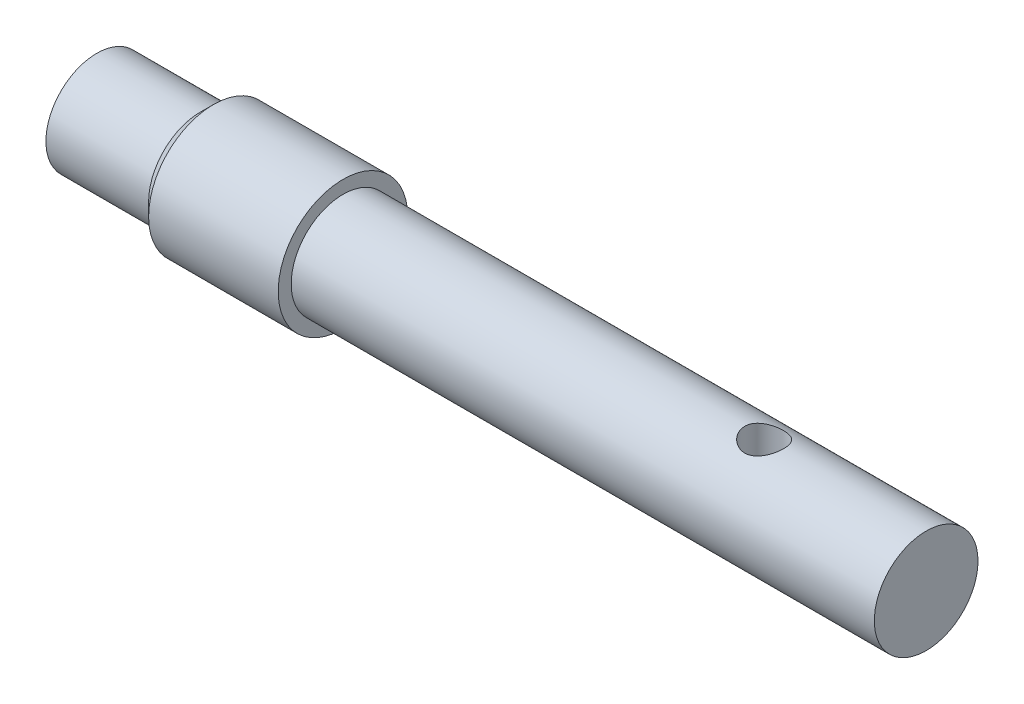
ISO-10303-21;
HEADER;
FILE_DESCRIPTION(('STEP AP214'),'2;1');
FILE_NAME('part.step','',(''),(''),'','','');
FILE_SCHEMA(('AUTOMOTIVE_DESIGN { 1 0 10303 214 1 1 1 1 }'));
ENDSEC;
DATA;
#1=APPLICATION_CONTEXT('core data for automotive mechanical design processes');
#2=APPLICATION_PROTOCOL_DEFINITION('international standard','automotive_design',2000,#1);
#3=PRODUCT_CONTEXT('',#1,'mechanical');
#4=PRODUCT('Part','Part','',(#3));
#5=PRODUCT_RELATED_PRODUCT_CATEGORY('part','',(#4));
#6=PRODUCT_DEFINITION_FORMATION('','',#4);
#7=PRODUCT_DEFINITION_CONTEXT('part definition',#1,'design');
#8=PRODUCT_DEFINITION('design','',#6,#7);
#9=PRODUCT_DEFINITION_SHAPE('','',#8);
#10=(LENGTH_UNIT() NAMED_UNIT(*) SI_UNIT(.MILLI.,.METRE.));
#11=(NAMED_UNIT(*) PLANE_ANGLE_UNIT() SI_UNIT($,.RADIAN.));
#12=(NAMED_UNIT(*) SI_UNIT($,.STERADIAN.) SOLID_ANGLE_UNIT());
#13=UNCERTAINTY_MEASURE_WITH_UNIT(LENGTH_MEASURE(1.E-05),#10,'distance_accuracy_value','');
#14=(GEOMETRIC_REPRESENTATION_CONTEXT(3) GLOBAL_UNCERTAINTY_ASSIGNED_CONTEXT((#13)) GLOBAL_UNIT_ASSIGNED_CONTEXT((#10,
#11,#12)) REPRESENTATION_CONTEXT('',''));
#15=CARTESIAN_POINT('',(0.,0.,0.));
#16=DIRECTION('',(0.,0.,1.));
#17=DIRECTION('',(1.,0.,0.));
#18=AXIS2_PLACEMENT_3D('',#15,#16,#17);
#19=CARTESIAN_POINT('',(56.,0.,0.));
#20=DIRECTION('',(1.,0.,0.));
#21=DIRECTION('',(0.,0.,-1.00000000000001));
#22=AXIS2_PLACEMENT_3D('',#19,#20,#21);
#23=PLANE('',#22);
#24=CARTESIAN_POINT('',(56.,0.,0.));
#25=DIRECTION('',(1.,0.,0.));
#26=DIRECTION('',(0.,0.,-1.00000000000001));
#27=AXIS2_PLACEMENT_3D('',#24,#25,#26);
#28=CIRCLE('',#27,4.);
#29=CARTESIAN_POINT('',(56.,0.,-4.00000000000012));
#30=VERTEX_POINT('',#29);
#31=EDGE_CURVE('E80',#30,#30,#28,.T.);
#32=ORIENTED_EDGE('',*,*,#31,.T.);
#33=EDGE_LOOP('',(#32));
#34=FACE_BOUND('',#33,.T.);
#35=ADVANCED_FACE('F34',(#34),#23,.T.);
#36=CARTESIAN_POINT('',(0.,0.,0.));
#37=DIRECTION('',(1.,0.,0.));
#38=DIRECTION('',(0.,0.,-1.00000000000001));
#39=AXIS2_PLACEMENT_3D('',#36,#37,#38);
#40=CYLINDRICAL_SURFACE('',#39,4.);
#41=CARTESIAN_POINT('',(43.5,-3.70809924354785,1.5));
#42=CARTESIAN_POINT('',(43.4189925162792,-3.70809640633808,1.50000304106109));
#43=CARTESIAN_POINT('',(43.3380050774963,-3.71078260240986,1.49341597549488));
#44=CARTESIAN_POINT('',(43.1784719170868,-3.72116159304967,1.46736187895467));
#45=CARTESIAN_POINT('',(43.099926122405,-3.72885423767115,1.4478952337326));
#46=CARTESIAN_POINT('',(42.9476246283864,-3.74825480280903,1.3968965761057));
#47=CARTESIAN_POINT('',(42.8738579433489,-3.75995309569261,1.36539347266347));
#48=CARTESIAN_POINT('',(42.7326281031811,-3.78603134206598,1.29131856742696));
#49=CARTESIAN_POINT('',(42.6651668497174,-3.80041210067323,1.24874344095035));
#50=CARTESIAN_POINT('',(42.5351096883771,-3.83103574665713,1.15146661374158));
#51=CARTESIAN_POINT('',(42.4728714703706,-3.84733341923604,1.09630381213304));
#52=CARTESIAN_POINT('',(42.3582771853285,-3.87949750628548,0.9763958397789));
#53=CARTESIAN_POINT('',(42.3059232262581,-3.89536382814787,0.911648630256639));
#54=CARTESIAN_POINT('',(42.2108604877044,-3.92552873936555,0.771694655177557));
#55=CARTESIAN_POINT('',(42.1685405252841,-3.93975561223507,0.696206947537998));
#56=CARTESIAN_POINT('',(42.0973488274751,-3.96438007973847,0.53855577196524));
#57=CARTESIAN_POINT('',(42.068472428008,-3.97477900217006,0.456394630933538));
#58=CARTESIAN_POINT('',(42.0262421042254,-3.99018697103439,0.291489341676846));
#59=CARTESIAN_POINT('',(42.0122723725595,-3.99540915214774,0.208923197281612));
#60=CARTESIAN_POINT('',(41.998278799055,-4.0006401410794,0.042464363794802));
#61=CARTESIAN_POINT('',(41.9982504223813,-4.00065064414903,-0.0414278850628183));
#62=CARTESIAN_POINT('',(42.0117817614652,-3.99559265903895,-0.203743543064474));
#63=CARTESIAN_POINT('',(42.0246692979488,-3.99077541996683,-0.282232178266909));
#64=CARTESIAN_POINT('',(42.0625359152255,-3.97693274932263,-0.435839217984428));
#65=CARTESIAN_POINT('',(42.087515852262,-3.96790701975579,-0.510957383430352));
#66=CARTESIAN_POINT('',(42.1491704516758,-3.94637769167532,-0.656989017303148));
#67=CARTESIAN_POINT('',(42.1860100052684,-3.93382539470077,-0.727825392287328));
#68=CARTESIAN_POINT('',(42.2701920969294,-3.90651310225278,-0.862486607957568));
#69=CARTESIAN_POINT('',(42.3175380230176,-3.8917523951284,-0.926309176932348));
#70=CARTESIAN_POINT('',(42.4246272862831,-3.86052529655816,-1.04909048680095));
#71=CARTESIAN_POINT('',(42.4849339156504,-3.84400963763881,-1.10754614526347));
#72=CARTESIAN_POINT('',(42.6145929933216,-3.81182460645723,-1.21370395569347));
#73=CARTESIAN_POINT('',(42.6839477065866,-3.79615544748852,-1.26140340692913));
#74=CARTESIAN_POINT('',(42.8317194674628,-3.7671270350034,-1.34565611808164));
#75=CARTESIAN_POINT('',(42.910303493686,-3.75382677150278,-1.38193847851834));
#76=CARTESIAN_POINT('',(43.0730962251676,-3.73172438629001,-1.44056464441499));
#77=CARTESIAN_POINT('',(43.1573017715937,-3.72291976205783,-1.46291620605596));
#78=CARTESIAN_POINT('',(43.3239759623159,-3.71139597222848,-1.4919019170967));
#79=CARTESIAN_POINT('',(43.4062841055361,-3.70836785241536,-1.49933521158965));
#80=CARTESIAN_POINT('',(43.5710093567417,-3.70786539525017,-1.50057885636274));
#81=CARTESIAN_POINT('',(43.6534264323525,-3.7103896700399,-1.49439261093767));
#82=CARTESIAN_POINT('',(43.8119299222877,-3.72039381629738,-1.46929733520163));
#83=CARTESIAN_POINT('',(43.8881311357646,-3.7276327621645,-1.45100618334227));
#84=CARTESIAN_POINT('',(44.0363479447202,-3.7459648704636,-1.40299774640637));
#85=CARTESIAN_POINT('',(44.1083626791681,-3.75705882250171,-1.37327812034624));
#86=CARTESIAN_POINT('',(44.2491644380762,-3.78236243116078,-1.30200292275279));
#87=CARTESIAN_POINT('',(44.3177292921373,-3.79667328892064,-1.26004545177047));
#88=CARTESIAN_POINT('',(44.447128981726,-3.82662814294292,-1.16591317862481));
#89=CARTESIAN_POINT('',(44.5079609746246,-3.84227262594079,-1.11373463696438));
#90=CARTESIAN_POINT('',(44.6241683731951,-3.87433046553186,-0.996727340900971));
#91=CARTESIAN_POINT('',(44.6789534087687,-3.89072969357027,-0.931306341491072));
#92=CARTESIAN_POINT('',(44.7768383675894,-3.92149874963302,-0.791797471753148));
#93=CARTESIAN_POINT('',(44.8199382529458,-3.93586857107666,-0.71770957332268));
#94=CARTESIAN_POINT('',(44.8929460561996,-3.96094985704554,-0.56301632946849));
#95=CARTESIAN_POINT('',(44.9228991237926,-3.9716738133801,-0.482434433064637));
#96=CARTESIAN_POINT('',(44.9686564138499,-3.98829436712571,-0.316881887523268));
#97=CARTESIAN_POINT('',(44.9844672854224,-3.99419323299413,-0.231913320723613));
#98=CARTESIAN_POINT('',(45.0007744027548,-4.00028407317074,-0.0653355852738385));
#99=CARTESIAN_POINT('',(45.002109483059,-4.00078860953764,0.0161807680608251));
#100=CARTESIAN_POINT('',(44.9915848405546,-3.99684889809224,0.178226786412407));
#101=CARTESIAN_POINT('',(44.9797267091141,-3.99240524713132,0.25875656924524));
#102=CARTESIAN_POINT('',(44.9437411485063,-3.97921089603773,0.414548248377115));
#103=CARTESIAN_POINT('',(44.9199200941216,-3.97056791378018,0.489890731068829));
#104=CARTESIAN_POINT('',(44.8609899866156,-3.9498778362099,0.635515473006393));
#105=CARTESIAN_POINT('',(44.8258787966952,-3.93783009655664,0.705796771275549));
#106=CARTESIAN_POINT('',(44.7436860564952,-3.91090618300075,0.842540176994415));
#107=CARTESIAN_POINT('',(44.6961633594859,-3.89593240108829,0.908717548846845));
#108=CARTESIAN_POINT('',(44.5911921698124,-3.86499507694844,1.03241734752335));
#109=CARTESIAN_POINT('',(44.5337401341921,-3.84903118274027,1.08993667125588));
#110=CARTESIAN_POINT('',(44.406935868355,-3.81688129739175,1.19781214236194));
#111=CARTESIAN_POINT('',(44.3371155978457,-3.8007280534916,1.24762999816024));
#112=CARTESIAN_POINT('',(44.1895841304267,-3.77098325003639,1.33484709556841));
#113=CARTESIAN_POINT('',(44.1118721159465,-3.75739195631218,1.37224504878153));
#114=CARTESIAN_POINT('',(43.9470443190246,-3.73402269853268,1.43465886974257));
#115=CARTESIAN_POINT('',(43.8596656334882,-3.7244380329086,1.45906002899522));
#116=CARTESIAN_POINT('',(43.6815147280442,-3.71147994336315,1.4917235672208));
#117=CARTESIAN_POINT('',(43.59074478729,-3.70810242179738,1.49999659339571));
#118=CARTESIAN_POINT('',(43.5,-3.70809924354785,1.5));
#119=B_SPLINE_CURVE_WITH_KNOTS('',3,(#41,#42,#43,#44,#45,#46,#47,#48,#49,#50,#51,#52,#53,#54,
#55,#56,#57,#58,#59,#60,#61,#62,#63,#64,#65,#66,#67,#68,#69,#70,#71,#72,#73,#74,#75,#76,#77,#78,
#79,#80,#81,#82,#83,#84,#85,#86,#87,#88,#89,#90,#91,#92,#93,#94,#95,#96,#97,#98,#99,#100,#101,
#102,#103,#104,#105,#106,#107,#108,#109,#110,#111,#112,#113,#114,#115,#116,#117,#118),
.UNSPECIFIED.,.T.,.F.,(4,2,2,2,2,2,2,2,2,2,2,2,2,2,2,2,2,2,2,2,2,2,2,2,2,2,2,2,2,2,2,2,2,2,2,2,
2,2,4),(0.,0.242684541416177,0.485361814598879,0.727459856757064,0.969630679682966,
1.22274652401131,1.47591628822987,1.73770072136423,1.99939426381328,2.24980018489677,
2.50012465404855,2.73806472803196,2.9760216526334,3.21744131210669,3.45893893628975,
3.71456675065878,3.97025867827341,4.23162592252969,4.49284751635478,4.73965657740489,
4.98640395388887,5.221438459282,5.45652113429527,5.70041561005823,5.94439948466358,
6.20385016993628,6.46330169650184,6.72185508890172,6.98028685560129,7.22365720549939,
7.46699820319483,7.70440274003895,7.94185223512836,8.1892832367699,8.43680270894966,
8.69738599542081,8.95799630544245,9.23003178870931,9.50188762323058),.UNSPECIFIED.);
#120=CARTESIAN_POINT('',(43.5,-3.70809924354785,1.5));
#121=VERTEX_POINT('',#120);
#122=EDGE_CURVE('E37',#121,#121,#119,.T.);
#123=ORIENTED_EDGE('',*,*,#122,.F.);
#124=EDGE_LOOP('',(#123));
#125=FACE_BOUND('',#124,.T.);
#126=CARTESIAN_POINT('',(43.5,3.70809924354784,1.50000000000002));
#127=CARTESIAN_POINT('',(43.5810074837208,3.70809640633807,1.5000030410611));
#128=CARTESIAN_POINT('',(43.6619949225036,3.71078260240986,1.49341597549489));
#129=CARTESIAN_POINT('',(43.8215280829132,3.72116159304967,1.46736187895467));
#130=CARTESIAN_POINT('',(43.900073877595,3.72885423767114,1.4478952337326));
#131=CARTESIAN_POINT('',(44.0523753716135,3.74825480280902,1.3968965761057));
#132=CARTESIAN_POINT('',(44.1261420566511,3.75995309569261,1.36539347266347));
#133=CARTESIAN_POINT('',(44.2673718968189,3.78603134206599,1.29131856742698));
#134=CARTESIAN_POINT('',(44.3348331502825,3.80041210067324,1.24874344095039));
#135=CARTESIAN_POINT('',(44.4648903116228,3.83103574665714,1.15146661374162));
#136=CARTESIAN_POINT('',(44.5271285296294,3.84733341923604,1.09630381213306));
#137=CARTESIAN_POINT('',(44.6417228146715,3.87949750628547,0.97639583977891));
#138=CARTESIAN_POINT('',(44.6940767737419,3.89536382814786,0.911648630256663));
#139=CARTESIAN_POINT('',(44.7891395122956,3.92552873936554,0.771694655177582));
#140=CARTESIAN_POINT('',(44.8314594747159,3.93975561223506,0.69620694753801));
#141=CARTESIAN_POINT('',(44.9026511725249,3.96438007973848,0.53855577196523));
#142=CARTESIAN_POINT('',(44.931527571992,3.97477900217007,0.45639463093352));
#143=CARTESIAN_POINT('',(44.9737578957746,3.99018697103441,0.29148934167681));
#144=CARTESIAN_POINT('',(44.9877276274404,3.99540915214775,0.208923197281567));
#145=CARTESIAN_POINT('',(45.001721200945,4.0006401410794,0.0424643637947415));
#146=CARTESIAN_POINT('',(45.0017495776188,4.00065064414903,-0.0414278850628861));
#147=CARTESIAN_POINT('',(44.9882182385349,3.99559265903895,-0.203743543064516));
#148=CARTESIAN_POINT('',(44.9753307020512,3.99077541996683,-0.28223217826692));
#149=CARTESIAN_POINT('',(44.9374640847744,3.97693274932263,-0.435839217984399));
#150=CARTESIAN_POINT('',(44.912484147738,3.96790701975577,-0.510957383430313));
#151=CARTESIAN_POINT('',(44.8508295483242,3.94637769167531,-0.656989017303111));
#152=CARTESIAN_POINT('',(44.8139899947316,3.93382539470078,-0.727825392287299));
#153=CARTESIAN_POINT('',(44.7298079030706,3.90651310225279,-0.862486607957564));
#154=CARTESIAN_POINT('',(44.6824619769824,3.89175239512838,-0.926309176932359));
#155=CARTESIAN_POINT('',(44.5753727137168,3.86052529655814,-1.04909048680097));
#156=CARTESIAN_POINT('',(44.5150660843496,3.84400963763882,-1.10754614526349));
#157=CARTESIAN_POINT('',(44.3854070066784,3.81182460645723,-1.21370395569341));
#158=CARTESIAN_POINT('',(44.3160522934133,3.79615544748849,-1.26140340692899));
#159=CARTESIAN_POINT('',(44.1682805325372,3.76712703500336,-1.34565611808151));
#160=CARTESIAN_POINT('',(44.0896965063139,3.75382677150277,-1.3819384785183));
#161=CARTESIAN_POINT('',(43.9269037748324,3.73172438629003,-1.44056464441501));
#162=CARTESIAN_POINT('',(43.8426982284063,3.72291976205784,-1.46291620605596));
#163=CARTESIAN_POINT('',(43.6760240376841,3.71139597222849,-1.4919019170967));
#164=CARTESIAN_POINT('',(43.5937158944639,3.70836785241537,-1.49933521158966));
#165=CARTESIAN_POINT('',(43.4289906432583,3.70786539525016,-1.50057885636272));
#166=CARTESIAN_POINT('',(43.3465735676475,3.71038967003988,-1.49439261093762));
#167=CARTESIAN_POINT('',(43.1880700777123,3.72039381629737,-1.46929733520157));
#168=CARTESIAN_POINT('',(43.1118688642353,3.72763276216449,-1.45100618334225));
#169=CARTESIAN_POINT('',(42.9636520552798,3.74596487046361,-1.40299774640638));
#170=CARTESIAN_POINT('',(42.8916373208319,3.75705882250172,-1.37327812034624));
#171=CARTESIAN_POINT('',(42.7508355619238,3.78236243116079,-1.30200292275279));
#172=CARTESIAN_POINT('',(42.6822707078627,3.79667328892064,-1.26004545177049));
#173=CARTESIAN_POINT('',(42.552871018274,3.82662814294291,-1.16591317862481));
#174=CARTESIAN_POINT('',(42.4920390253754,3.84227262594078,-1.11373463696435));
#175=CARTESIAN_POINT('',(42.3758316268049,3.87433046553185,-0.996727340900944));
#176=CARTESIAN_POINT('',(42.3210465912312,3.89072969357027,-0.93130634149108));
#177=CARTESIAN_POINT('',(42.2231616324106,3.92149874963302,-0.79179747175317));
#178=CARTESIAN_POINT('',(42.1800617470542,3.93586857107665,-0.717709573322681));
#179=CARTESIAN_POINT('',(42.1070539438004,3.96094985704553,-0.56301632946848));
#180=CARTESIAN_POINT('',(42.0771008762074,3.9716738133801,-0.482434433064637));
#181=CARTESIAN_POINT('',(42.0313435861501,3.98829436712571,-0.316881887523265));
#182=CARTESIAN_POINT('',(42.0155327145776,3.99419323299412,-0.231913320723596));
#183=CARTESIAN_POINT('',(41.9992255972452,4.00028407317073,-0.065335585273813));
#184=CARTESIAN_POINT('',(41.997890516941,4.00078860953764,0.0161807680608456));
#185=CARTESIAN_POINT('',(42.0084151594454,3.99684889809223,0.178226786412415));
#186=CARTESIAN_POINT('',(42.0202732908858,3.9924052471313,0.258756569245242));
#187=CARTESIAN_POINT('',(42.0562588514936,3.97921089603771,0.41454824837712));
#188=CARTESIAN_POINT('',(42.0800799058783,3.97056791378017,0.489890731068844));
#189=CARTESIAN_POINT('',(42.1390100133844,3.9498778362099,0.635515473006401));
#190=CARTESIAN_POINT('',(42.1741212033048,3.93783009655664,0.705796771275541));
#191=CARTESIAN_POINT('',(42.2563139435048,3.91090618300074,0.842540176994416));
#192=CARTESIAN_POINT('',(42.3038366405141,3.89593240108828,0.908717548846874));
#193=CARTESIAN_POINT('',(42.4088078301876,3.86499507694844,1.03241734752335));
#194=CARTESIAN_POINT('',(42.4662598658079,3.84903118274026,1.08993667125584));
#195=CARTESIAN_POINT('',(42.5930641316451,3.81688129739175,1.1978121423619));
#196=CARTESIAN_POINT('',(42.6628844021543,3.8007280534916,1.24762999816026));
#197=CARTESIAN_POINT('',(42.8104158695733,3.77098325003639,1.33484709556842));
#198=CARTESIAN_POINT('',(42.8881278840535,3.75739195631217,1.37224504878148));
#199=CARTESIAN_POINT('',(43.0529556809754,3.73402269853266,1.43465886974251));
#200=CARTESIAN_POINT('',(43.1403343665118,3.72443803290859,1.4590600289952));
#201=CARTESIAN_POINT('',(43.3184852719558,3.71147994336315,1.49172356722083));
#202=CARTESIAN_POINT('',(43.40925521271,3.70810242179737,1.49999659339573));
#203=CARTESIAN_POINT('',(43.5,3.70809924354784,1.50000000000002));
#204=B_SPLINE_CURVE_WITH_KNOTS('',3,(#126,#127,#128,#129,#130,#131,#132,#133,#134,#135,#136,
#137,#138,#139,#140,#141,#142,#143,#144,#145,#146,#147,#148,#149,#150,#151,#152,#153,#154,#155,
#156,#157,#158,#159,#160,#161,#162,#163,#164,#165,#166,#167,#168,#169,#170,#171,#172,#173,#174,
#175,#176,#177,#178,#179,#180,#181,#182,#183,#184,#185,#186,#187,#188,#189,#190,#191,#192,#193,
#194,#195,#196,#197,#198,#199,#200,#201,#202,#203),.UNSPECIFIED.,.T.,.F.,(4,2,2,2,2,2,2,2,2,2,2,
2,2,2,2,2,2,2,2,2,2,2,2,2,2,2,2,2,2,2,2,2,2,2,2,2,2,2,4),(0.,0.242684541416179,
0.485361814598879,0.72745985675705,0.969630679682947,1.2227465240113,1.47591628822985,
1.73770072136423,1.99939426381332,2.24980018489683,2.50012465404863,2.73806472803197,
2.97602165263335,3.2174413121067,3.4589389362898,3.71456675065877,3.97025867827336,
4.23162592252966,4.49284751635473,4.73965657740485,4.98640395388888,5.221438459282,
5.45652113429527,5.70041561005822,5.94439948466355,6.20385016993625,6.4633016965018,
6.72185508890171,6.9802868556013,7.22365720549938,7.46699820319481,7.70440274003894,
7.94185223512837,8.1892832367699,8.43680270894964,8.69738599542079,8.95799630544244,
9.23003178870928,9.50188762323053),.UNSPECIFIED.);
#205=CARTESIAN_POINT('',(43.5,3.70809924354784,1.50000000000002));
#206=VERTEX_POINT('',#205);
#207=EDGE_CURVE('E64',#206,#206,#204,.T.);
#208=ORIENTED_EDGE('',*,*,#207,.F.);
#209=EDGE_LOOP('',(#208));
#210=FACE_BOUND('',#209,.T.);
#211=CARTESIAN_POINT('',(11.,0.,0.));
#212=DIRECTION('',(1.,0.,0.));
#213=DIRECTION('',(0.,0.,-1.00000000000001));
#214=AXIS2_PLACEMENT_3D('',#211,#212,#213);
#215=CIRCLE('',#214,4.);
#216=CARTESIAN_POINT('',(11.,0.,-4.00000000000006));
#217=VERTEX_POINT('',#216);
#218=EDGE_CURVE('E77',#217,#217,#215,.T.);
#219=ORIENTED_EDGE('',*,*,#218,.T.);
#220=EDGE_LOOP('',(#219));
#221=FACE_BOUND('',#220,.T.);
#222=ORIENTED_EDGE('',*,*,#31,.F.);
#223=EDGE_LOOP('',(#222));
#224=FACE_BOUND('',#223,.T.);
#225=ADVANCED_FACE('F88',(#125,#210,#221,#224),#40,.T.);
#226=CARTESIAN_POINT('',(11.,4.,0.));
#227=DIRECTION('',(1.,0.,0.));
#228=DIRECTION('',(0.,0.,-1.00000000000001));
#229=AXIS2_PLACEMENT_3D('',#226,#227,#228);
#230=PLANE('',#229);
#231=CARTESIAN_POINT('',(11.,0.,0.));
#232=DIRECTION('',(1.,0.,0.));
#233=DIRECTION('',(0.,0.,-1.00000000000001));
#234=AXIS2_PLACEMENT_3D('',#231,#232,#233);
#235=CIRCLE('',#234,5.);
#236=CARTESIAN_POINT('',(11.,0.,-5.00000000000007));
#237=VERTEX_POINT('',#236);
#238=EDGE_CURVE('E74',#237,#237,#235,.T.);
#239=ORIENTED_EDGE('',*,*,#238,.T.);
#240=EDGE_LOOP('',(#239));
#241=FACE_BOUND('',#240,.T.);
#242=ORIENTED_EDGE('',*,*,#218,.F.);
#243=EDGE_LOOP('',(#242));
#244=FACE_BOUND('',#243,.T.);
#245=ADVANCED_FACE('F120',(#241,#244),#230,.T.);
#246=CARTESIAN_POINT('',(0.,0.,0.));
#247=DIRECTION('',(1.,0.,0.));
#248=DIRECTION('',(0.,0.,-1.00000000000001));
#249=AXIS2_PLACEMENT_3D('',#246,#247,#248);
#250=CYLINDRICAL_SURFACE('',#249,5.);
#251=CARTESIAN_POINT('',(1.,0.,0.));
#252=DIRECTION('',(-1.,0.,0.));
#253=DIRECTION('',(0.,0.,1.00000000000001));
#254=AXIS2_PLACEMENT_3D('',#251,#252,#253);
#255=CIRCLE('',#254,5.);
#256=CARTESIAN_POINT('',(1.,0.,5.00000000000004));
#257=VERTEX_POINT('',#256);
#258=EDGE_CURVE('E44',#257,#257,#255,.F.);
#259=ORIENTED_EDGE('',*,*,#258,.T.);
#260=EDGE_LOOP('',(#259));
#261=FACE_BOUND('',#260,.T.);
#262=ORIENTED_EDGE('',*,*,#238,.F.);
#263=EDGE_LOOP('',(#262));
#264=FACE_BOUND('',#263,.T.);
#265=ADVANCED_FACE('F117',(#261,#264),#250,.T.);
#266=CARTESIAN_POINT('',(0.,3.925,0.));
#267=DIRECTION('',(-1.,0.,0.));
#268=DIRECTION('',(0.,0.,1.00000000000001));
#269=AXIS2_PLACEMENT_3D('',#266,#267,#268);
#270=PLANE('',#269);
#271=CARTESIAN_POINT('',(0.,0.,0.));
#272=DIRECTION('',(-1.,0.,0.));
#273=DIRECTION('',(0.,0.,1.00000000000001));
#274=AXIS2_PLACEMENT_3D('',#271,#272,#273);
#275=CIRCLE('',#274,4.);
#276=CARTESIAN_POINT('',(0.,0.,4.00000000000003));
#277=VERTEX_POINT('',#276);
#278=EDGE_CURVE('E11',#277,#277,#275,.T.);
#279=ORIENTED_EDGE('',*,*,#278,.T.);
#280=EDGE_LOOP('',(#279));
#281=FACE_BOUND('',#280,.T.);
#282=CARTESIAN_POINT('',(0.,0.,0.));
#283=DIRECTION('',(1.,0.,0.));
#284=DIRECTION('',(0.,0.,-1.00000000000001));
#285=AXIS2_PLACEMENT_3D('',#282,#283,#284);
#286=CIRCLE('',#285,3.925);
#287=CARTESIAN_POINT('',(0.,0.,-3.92500000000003));
#288=VERTEX_POINT('',#287);
#289=EDGE_CURVE('E71',#288,#288,#286,.T.);
#290=ORIENTED_EDGE('',*,*,#289,.T.);
#291=EDGE_LOOP('',(#290));
#292=FACE_BOUND('',#291,.T.);
#293=ADVANCED_FACE('F113',(#281,#292),#270,.T.);
#294=CARTESIAN_POINT('',(0.,0.,0.));
#295=DIRECTION('',(1.,0.,0.));
#296=DIRECTION('',(0.,0.,-1.00000000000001));
#297=AXIS2_PLACEMENT_3D('',#294,#295,#296);
#298=CYLINDRICAL_SURFACE('',#297,3.925);
#299=CARTESIAN_POINT('',(-8.00000000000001,0.,0.));
#300=DIRECTION('',(1.,0.,0.));
#301=DIRECTION('',(0.,0.,-1.00000000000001));
#302=AXIS2_PLACEMENT_3D('',#299,#300,#301);
#303=CIRCLE('',#302,3.925);
#304=CARTESIAN_POINT('',(-8.00000000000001,0.,-3.92500000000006));
#305=VERTEX_POINT('',#304);
#306=EDGE_CURVE('E68',#305,#305,#303,.T.);
#307=ORIENTED_EDGE('',*,*,#306,.T.);
#308=EDGE_LOOP('',(#307));
#309=FACE_BOUND('',#308,.T.);
#310=ORIENTED_EDGE('',*,*,#289,.F.);
#311=EDGE_LOOP('',(#310));
#312=FACE_BOUND('',#311,.T.);
#313=ADVANCED_FACE('F109',(#309,#312),#298,.T.);
#314=CARTESIAN_POINT('',(-8.00000000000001,3.86639078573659,0.));
#315=DIRECTION('',(-1.,0.,0.));
#316=DIRECTION('',(0.,0.,1.00000000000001));
#317=AXIS2_PLACEMENT_3D('',#314,#315,#316);
#318=PLANE('',#317);
#319=CARTESIAN_POINT('',(-8.00000000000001,0.,0.));
#320=DIRECTION('',(1.,0.,0.));
#321=DIRECTION('',(0.,0.,-1.00000000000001));
#322=AXIS2_PLACEMENT_3D('',#319,#320,#321);
#323=CIRCLE('',#322,3.86639078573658);
#324=CARTESIAN_POINT('',(-8.00000000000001,0.,-3.86639078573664));
#325=VERTEX_POINT('',#324);
#326=EDGE_CURVE('E61',#325,#325,#323,.T.);
#327=ORIENTED_EDGE('',*,*,#326,.T.);
#328=EDGE_LOOP('',(#327));
#329=FACE_BOUND('',#328,.T.);
#330=ORIENTED_EDGE('',*,*,#306,.F.);
#331=EDGE_LOOP('',(#330));
#332=FACE_BOUND('',#331,.T.);
#333=ADVANCED_FACE('F105',(#329,#332),#318,.T.);
#334=CARTESIAN_POINT('',(-8.00000000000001,0.,0.));
#335=DIRECTION('',(-1.,0.,0.));
#336=DIRECTION('',(0.,0.,1.00000000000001));
#337=AXIS2_PLACEMENT_3D('',#334,#335,#336);
#338=CONICAL_SURFACE('',#337,3.86639078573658,0.523598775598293);
#339=CARTESIAN_POINT('',(-3.90129092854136,0.,0.));
#340=DIRECTION('',(1.,0.,0.));
#341=DIRECTION('',(0.,0.,-1.00000000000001));
#342=AXIS2_PLACEMENT_3D('',#339,#340,#341);
#343=CIRCLE('',#342,1.5);
#344=CARTESIAN_POINT('',(-3.90129092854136,0.,-1.50000000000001));
#345=VERTEX_POINT('',#344);
#346=EDGE_CURVE('E58',#345,#345,#343,.T.);
#347=ORIENTED_EDGE('',*,*,#346,.T.);
#348=EDGE_LOOP('',(#347));
#349=FACE_BOUND('',#348,.T.);
#350=ORIENTED_EDGE('',*,*,#326,.F.);
#351=EDGE_LOOP('',(#350));
#352=FACE_BOUND('',#351,.T.);
#353=ADVANCED_FACE('F102',(#349,#352),#338,.F.);
#354=CARTESIAN_POINT('',(0.,0.,0.));
#355=DIRECTION('',(1.,0.,0.));
#356=DIRECTION('',(0.,0.,-1.00000000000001));
#357=AXIS2_PLACEMENT_3D('',#354,#355,#356);
#358=CYLINDRICAL_SURFACE('',#357,1.5);
#359=CARTESIAN_POINT('',(-0.901290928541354,0.,0.));
#360=DIRECTION('',(1.,0.,0.));
#361=DIRECTION('',(0.,0.,-1.00000000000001));
#362=AXIS2_PLACEMENT_3D('',#359,#360,#361);
#363=CIRCLE('',#362,1.5);
#364=CARTESIAN_POINT('',(-0.901290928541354,0.,-1.50000000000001));
#365=VERTEX_POINT('',#364);
#366=EDGE_CURVE('E56',#365,#365,#363,.T.);
#367=ORIENTED_EDGE('',*,*,#366,.T.);
#368=EDGE_LOOP('',(#367));
#369=FACE_BOUND('',#368,.T.);
#370=ORIENTED_EDGE('',*,*,#346,.F.);
#371=EDGE_LOOP('',(#370));
#372=FACE_BOUND('',#371,.T.);
#373=ADVANCED_FACE('F52',(#369,#372),#358,.F.);
#374=CARTESIAN_POINT('',(-0.901290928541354,0.,0.));
#375=DIRECTION('',(-1.,0.,0.));
#376=DIRECTION('',(0.,0.,1.00000000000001));
#377=AXIS2_PLACEMENT_3D('',#374,#375,#376);
#378=CONICAL_SURFACE('',#377,1.5,1.02974425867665);
#379=CARTESIAN_POINT('',(0.,0.,0.));
#380=VERTEX_POINT('',#379);
#381=VERTEX_LOOP('',#380);
#382=FACE_BOUND('',#381,.T.);
#383=ORIENTED_EDGE('',*,*,#366,.F.);
#384=EDGE_LOOP('',(#383));
#385=FACE_BOUND('',#384,.T.);
#386=ADVANCED_FACE('F48',(#382,#385),#378,.F.);
#387=CARTESIAN_POINT('',(1.,0.,0.));
#388=DIRECTION('',(1.,0.,0.));
#389=DIRECTION('',(0.,0.,-1.00000000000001));
#390=AXIS2_PLACEMENT_3D('',#387,#388,#389);
#391=CONICAL_SURFACE('',#390,5.,0.78539816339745);
#392=ORIENTED_EDGE('',*,*,#278,.F.);
#393=EDGE_LOOP('',(#392));
#394=FACE_BOUND('',#393,.T.);
#395=ORIENTED_EDGE('',*,*,#258,.F.);
#396=EDGE_LOOP('',(#395));
#397=FACE_BOUND('',#396,.T.);
#398=ADVANCED_FACE('F51',(#394,#397),#391,.T.);
#399=CARTESIAN_POINT('',(43.5,-5.00000000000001,0.));
#400=DIRECTION('',(0.,1.00000000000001,0.));
#401=DIRECTION('',(0.,0.,1.00000000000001));
#402=AXIS2_PLACEMENT_3D('',#399,#400,#401);
#403=CYLINDRICAL_SURFACE('',#402,1.5);
#404=ORIENTED_EDGE('',*,*,#122,.T.);
#405=EDGE_LOOP('',(#404));
#406=FACE_BOUND('',#405,.T.);
#407=ORIENTED_EDGE('',*,*,#207,.T.);
#408=EDGE_LOOP('',(#407));
#409=FACE_BOUND('',#408,.T.);
#410=ADVANCED_FACE('F91',(#406,#409),#403,.F.);
#411=CLOSED_SHELL('',(#35,#225,#245,#265,#293,#313,#333,#353,#373,#386,#398,#410));
#412=MANIFOLD_SOLID_BREP('B2',#411);
#413=ADVANCED_BREP_SHAPE_REPRESENTATION('',(#18,#412),#14);
#414=SHAPE_DEFINITION_REPRESENTATION(#9,#413);
ENDSEC;
END-ISO-10303-21;
